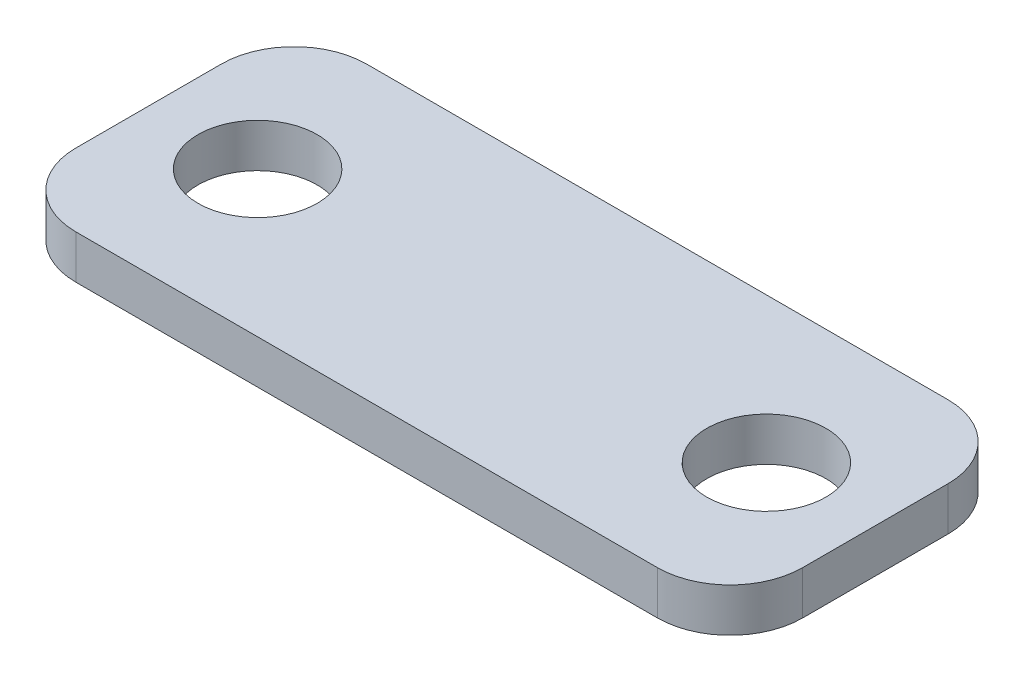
ISO-10303-21;
HEADER;
FILE_DESCRIPTION(('STEP AP214'),'2;1');
FILE_NAME('part.step','',(''),(''),'','','');
FILE_SCHEMA(('AUTOMOTIVE_DESIGN { 1 0 10303 214 1 1 1 1 }'));
ENDSEC;
DATA;
#1=APPLICATION_CONTEXT('core data for automotive mechanical design processes');
#2=APPLICATION_PROTOCOL_DEFINITION('international standard','automotive_design',2000,#1);
#3=PRODUCT_CONTEXT('',#1,'mechanical');
#4=PRODUCT('Part','Part','',(#3));
#5=PRODUCT_RELATED_PRODUCT_CATEGORY('part','',(#4));
#6=PRODUCT_DEFINITION_FORMATION('','',#4);
#7=PRODUCT_DEFINITION_CONTEXT('part definition',#1,'design');
#8=PRODUCT_DEFINITION('design','',#6,#7);
#9=PRODUCT_DEFINITION_SHAPE('','',#8);
#10=(LENGTH_UNIT() NAMED_UNIT(*) SI_UNIT(.MILLI.,.METRE.));
#11=(NAMED_UNIT(*) PLANE_ANGLE_UNIT() SI_UNIT($,.RADIAN.));
#12=(NAMED_UNIT(*) SI_UNIT($,.STERADIAN.) SOLID_ANGLE_UNIT());
#13=UNCERTAINTY_MEASURE_WITH_UNIT(LENGTH_MEASURE(1.E-05),#10,'distance_accuracy_value','');
#14=(GEOMETRIC_REPRESENTATION_CONTEXT(3) GLOBAL_UNCERTAINTY_ASSIGNED_CONTEXT((#13)) GLOBAL_UNIT_ASSIGNED_CONTEXT((#10,
#11,#12)) REPRESENTATION_CONTEXT('',''));
#15=CARTESIAN_POINT('',(0.,0.,0.));
#16=DIRECTION('',(0.,0.,1.));
#17=DIRECTION('',(1.,0.,0.));
#18=AXIS2_PLACEMENT_3D('',#15,#16,#17);
#19=CARTESIAN_POINT('',(25.,3.,10.));
#20=DIRECTION('',(-1.,0.,0.));
#21=DIRECTION('',(0.,0.,1.));
#22=AXIS2_PLACEMENT_3D('',#19,#20,#21);
#23=PLANE('',#22);
#24=DIRECTION('',(0.,0.,-1.));
#25=VECTOR('',#24,1.);
#26=CARTESIAN_POINT('',(25.,0.,10.));
#27=LINE('',#26,#25);
#28=CARTESIAN_POINT('',(25.,0.,5.));
#29=VERTEX_POINT('',#28);
#30=CARTESIAN_POINT('',(25.,0.,-5.));
#31=VERTEX_POINT('',#30);
#32=EDGE_CURVE('E127',#29,#31,#27,.T.);
#33=ORIENTED_EDGE('',*,*,#32,.T.);
#34=DIRECTION('',(0.,-1.,0.));
#35=VECTOR('',#34,1.);
#36=CARTESIAN_POINT('',(25.,3.,-5.));
#37=LINE('',#36,#35);
#38=CARTESIAN_POINT('',(25.,3.,-5.));
#39=VERTEX_POINT('',#38);
#40=EDGE_CURVE('E105',#31,#39,#37,.F.);
#41=ORIENTED_EDGE('',*,*,#40,.T.);
#42=DIRECTION('',(0.,0.,-1.));
#43=VECTOR('',#42,1.);
#44=CARTESIAN_POINT('',(25.,3.,10.));
#45=LINE('',#44,#43);
#46=CARTESIAN_POINT('',(25.,3.,5.));
#47=VERTEX_POINT('',#46);
#48=EDGE_CURVE('E137',#47,#39,#45,.T.);
#49=ORIENTED_EDGE('',*,*,#48,.F.);
#50=DIRECTION('',(0.,-1.,0.));
#51=VECTOR('',#50,1.);
#52=CARTESIAN_POINT('',(25.,3.,5.));
#53=LINE('',#52,#51);
#54=EDGE_CURVE('E110',#47,#29,#53,.T.);
#55=ORIENTED_EDGE('',*,*,#54,.T.);
#56=EDGE_LOOP('',(#33,#41,#49,#55));
#57=FACE_BOUND('',#56,.T.);
#58=ADVANCED_FACE('F34',(#57),#23,.F.);
#59=CARTESIAN_POINT('',(-25.,3.,-10.));
#60=DIRECTION('',(0.,0.,1.));
#61=DIRECTION('',(1.,0.,0.));
#62=AXIS2_PLACEMENT_3D('',#59,#60,#61);
#63=PLANE('',#62);
#64=DIRECTION('',(-1.,0.,0.));
#65=VECTOR('',#64,1.);
#66=CARTESIAN_POINT('',(-25.,3.,-10.));
#67=LINE('',#66,#65);
#68=CARTESIAN_POINT('',(20.,3.,-10.));
#69=VERTEX_POINT('',#68);
#70=CARTESIAN_POINT('',(-20.,3.,-10.));
#71=VERTEX_POINT('',#70);
#72=EDGE_CURVE('E120',#69,#71,#67,.T.);
#73=ORIENTED_EDGE('',*,*,#72,.F.);
#74=DIRECTION('',(0.,-1.,0.));
#75=VECTOR('',#74,1.);
#76=CARTESIAN_POINT('',(20.,3.,-10.));
#77=LINE('',#76,#75);
#78=CARTESIAN_POINT('',(20.,0.,-10.));
#79=VERTEX_POINT('',#78);
#80=EDGE_CURVE('E104',#69,#79,#77,.T.);
#81=ORIENTED_EDGE('',*,*,#80,.T.);
#82=DIRECTION('',(-1.,0.,0.));
#83=VECTOR('',#82,1.);
#84=CARTESIAN_POINT('',(-25.,0.,-10.));
#85=LINE('',#84,#83);
#86=CARTESIAN_POINT('',(-20.,0.,-10.));
#87=VERTEX_POINT('',#86);
#88=EDGE_CURVE('E117',#79,#87,#85,.T.);
#89=ORIENTED_EDGE('',*,*,#88,.T.);
#90=DIRECTION('',(0.,-1.,0.));
#91=VECTOR('',#90,1.);
#92=CARTESIAN_POINT('',(-20.,3.,-10.));
#93=LINE('',#92,#91);
#94=EDGE_CURVE('E122',#87,#71,#93,.F.);
#95=ORIENTED_EDGE('',*,*,#94,.T.);
#96=EDGE_LOOP('',(#73,#81,#89,#95));
#97=FACE_BOUND('',#96,.T.);
#98=ADVANCED_FACE('F116',(#97),#63,.F.);
#99=CARTESIAN_POINT('',(-25.,3.,10.));
#100=DIRECTION('',(1.,0.,0.));
#101=DIRECTION('',(0.,0.,-1.));
#102=AXIS2_PLACEMENT_3D('',#99,#100,#101);
#103=PLANE('',#102);
#104=DIRECTION('',(0.,0.,1.));
#105=VECTOR('',#104,1.);
#106=CARTESIAN_POINT('',(-25.,0.,10.));
#107=LINE('',#106,#105);
#108=CARTESIAN_POINT('',(-25.,0.,-5.));
#109=VERTEX_POINT('',#108);
#110=CARTESIAN_POINT('',(-25.,0.,5.));
#111=VERTEX_POINT('',#110);
#112=EDGE_CURVE('E126',#109,#111,#107,.T.);
#113=ORIENTED_EDGE('',*,*,#112,.T.);
#114=DIRECTION('',(0.,-1.,0.));
#115=VECTOR('',#114,1.);
#116=CARTESIAN_POINT('',(-25.,3.,5.));
#117=LINE('',#116,#115);
#118=CARTESIAN_POINT('',(-25.,3.,5.));
#119=VERTEX_POINT('',#118);
#120=EDGE_CURVE('E11',#111,#119,#117,.F.);
#121=ORIENTED_EDGE('',*,*,#120,.T.);
#122=DIRECTION('',(0.,0.,1.));
#123=VECTOR('',#122,1.);
#124=CARTESIAN_POINT('',(-25.,3.,10.));
#125=LINE('',#124,#123);
#126=CARTESIAN_POINT('',(-25.,3.,-5.));
#127=VERTEX_POINT('',#126);
#128=EDGE_CURVE('E163',#127,#119,#125,.T.);
#129=ORIENTED_EDGE('',*,*,#128,.F.);
#130=DIRECTION('',(0.,-1.,0.));
#131=VECTOR('',#130,1.);
#132=CARTESIAN_POINT('',(-25.,3.,-5.));
#133=LINE('',#132,#131);
#134=EDGE_CURVE('E42',#127,#109,#133,.T.);
#135=ORIENTED_EDGE('',*,*,#134,.T.);
#136=EDGE_LOOP('',(#113,#121,#129,#135));
#137=FACE_BOUND('',#136,.T.);
#138=ADVANCED_FACE('F161',(#137),#103,.F.);
#139=CARTESIAN_POINT('',(-25.,3.,10.));
#140=DIRECTION('',(0.,0.,-1.));
#141=DIRECTION('',(-1.,0.,0.));
#142=AXIS2_PLACEMENT_3D('',#139,#140,#141);
#143=PLANE('',#142);
#144=DIRECTION('',(1.,0.,0.));
#145=VECTOR('',#144,1.);
#146=CARTESIAN_POINT('',(-25.,0.,10.));
#147=LINE('',#146,#145);
#148=CARTESIAN_POINT('',(-20.,0.,10.));
#149=VERTEX_POINT('',#148);
#150=CARTESIAN_POINT('',(20.,0.,10.));
#151=VERTEX_POINT('',#150);
#152=EDGE_CURVE('E130',#149,#151,#147,.T.);
#153=ORIENTED_EDGE('',*,*,#152,.T.);
#154=DIRECTION('',(0.,-1.,0.));
#155=VECTOR('',#154,1.);
#156=CARTESIAN_POINT('',(20.,3.,10.));
#157=LINE('',#156,#155);
#158=CARTESIAN_POINT('',(20.,3.,10.));
#159=VERTEX_POINT('',#158);
#160=EDGE_CURVE('E49',#151,#159,#157,.F.);
#161=ORIENTED_EDGE('',*,*,#160,.T.);
#162=DIRECTION('',(1.,0.,0.));
#163=VECTOR('',#162,1.);
#164=CARTESIAN_POINT('',(-25.,3.,10.));
#165=LINE('',#164,#163);
#166=CARTESIAN_POINT('',(-20.,3.,10.));
#167=VERTEX_POINT('',#166);
#168=EDGE_CURVE('E138',#167,#159,#165,.T.);
#169=ORIENTED_EDGE('',*,*,#168,.F.);
#170=DIRECTION('',(0.,-1.,0.));
#171=VECTOR('',#170,1.);
#172=CARTESIAN_POINT('',(-20.,3.,10.));
#173=LINE('',#172,#171);
#174=EDGE_CURVE('E154',#167,#149,#173,.T.);
#175=ORIENTED_EDGE('',*,*,#174,.T.);
#176=EDGE_LOOP('',(#153,#161,#169,#175));
#177=FACE_BOUND('',#176,.T.);
#178=ADVANCED_FACE('F170',(#177),#143,.F.);
#179=CARTESIAN_POINT('',(0.,3.,0.));
#180=DIRECTION('',(0.,-1.,0.));
#181=DIRECTION('',(0.,0.,-1.));
#182=AXIS2_PLACEMENT_3D('',#179,#180,#181);
#183=PLANE('',#182);
#184=CARTESIAN_POINT('',(-17.5,3.,0.));
#185=DIRECTION('',(0.,1.,0.));
#186=DIRECTION('',(0.,0.,1.));
#187=AXIS2_PLACEMENT_3D('',#184,#185,#186);
#188=CIRCLE('',#187,4.1);
#189=CARTESIAN_POINT('',(-17.5,3.,4.1));
#190=VERTEX_POINT('',#189);
#191=EDGE_CURVE('E183',#190,#190,#188,.T.);
#192=ORIENTED_EDGE('',*,*,#191,.F.);
#193=EDGE_LOOP('',(#192));
#194=FACE_BOUND('',#193,.T.);
#195=CARTESIAN_POINT('',(17.5,3.,0.));
#196=DIRECTION('',(0.,1.,0.));
#197=DIRECTION('',(0.,0.,1.));
#198=AXIS2_PLACEMENT_3D('',#195,#196,#197);
#199=CIRCLE('',#198,4.1);
#200=CARTESIAN_POINT('',(17.5,3.,4.1));
#201=VERTEX_POINT('',#200);
#202=EDGE_CURVE('E177',#201,#201,#199,.T.);
#203=ORIENTED_EDGE('',*,*,#202,.F.);
#204=EDGE_LOOP('',(#203));
#205=FACE_BOUND('',#204,.T.);
#206=ORIENTED_EDGE('',*,*,#48,.T.);
#207=CARTESIAN_POINT('',(20.,3.,-5.));
#208=DIRECTION('',(0.,-1.,0.));
#209=DIRECTION('',(0.,0.,-1.));
#210=AXIS2_PLACEMENT_3D('',#207,#208,#209);
#211=CIRCLE('',#210,5.);
#212=EDGE_CURVE('E152',#39,#69,#211,.F.);
#213=ORIENTED_EDGE('',*,*,#212,.T.);
#214=ORIENTED_EDGE('',*,*,#72,.T.);
#215=CARTESIAN_POINT('',(-20.,3.,-5.));
#216=DIRECTION('',(0.,-1.,0.));
#217=DIRECTION('',(0.,0.,-1.));
#218=AXIS2_PLACEMENT_3D('',#215,#216,#217);
#219=CIRCLE('',#218,5.);
#220=EDGE_CURVE('E147',#71,#127,#219,.F.);
#221=ORIENTED_EDGE('',*,*,#220,.T.);
#222=ORIENTED_EDGE('',*,*,#128,.T.);
#223=CARTESIAN_POINT('',(-20.,3.,5.));
#224=DIRECTION('',(0.,-1.,0.));
#225=DIRECTION('',(0.,0.,-1.));
#226=AXIS2_PLACEMENT_3D('',#223,#224,#225);
#227=CIRCLE('',#226,5.);
#228=EDGE_CURVE('E56',#119,#167,#227,.F.);
#229=ORIENTED_EDGE('',*,*,#228,.T.);
#230=ORIENTED_EDGE('',*,*,#168,.T.);
#231=CARTESIAN_POINT('',(20.,3.,5.));
#232=DIRECTION('',(0.,-1.,0.));
#233=DIRECTION('',(0.,0.,-1.));
#234=AXIS2_PLACEMENT_3D('',#231,#232,#233);
#235=CIRCLE('',#234,5.);
#236=EDGE_CURVE('E150',#159,#47,#235,.F.);
#237=ORIENTED_EDGE('',*,*,#236,.T.);
#238=EDGE_LOOP('',(#206,#213,#214,#221,#222,#229,#230,#237));
#239=FACE_BOUND('',#238,.T.);
#240=ADVANCED_FACE('F198',(#194,#205,#239),#183,.F.);
#241=CARTESIAN_POINT('',(0.,0.,0.));
#242=DIRECTION('',(0.,-1.,0.));
#243=DIRECTION('',(0.,0.,-1.));
#244=AXIS2_PLACEMENT_3D('',#241,#242,#243);
#245=PLANE('',#244);
#246=CARTESIAN_POINT('',(-17.5,0.,0.));
#247=DIRECTION('',(0.,1.,0.));
#248=DIRECTION('',(0.,0.,1.));
#249=AXIS2_PLACEMENT_3D('',#246,#247,#248);
#250=CIRCLE('',#249,4.1);
#251=CARTESIAN_POINT('',(-17.5,0.,4.1));
#252=VERTEX_POINT('',#251);
#253=EDGE_CURVE('E132',#252,#252,#250,.T.);
#254=ORIENTED_EDGE('',*,*,#253,.T.);
#255=EDGE_LOOP('',(#254));
#256=FACE_BOUND('',#255,.T.);
#257=CARTESIAN_POINT('',(17.5,0.,0.));
#258=DIRECTION('',(0.,1.,0.));
#259=DIRECTION('',(0.,0.,1.));
#260=AXIS2_PLACEMENT_3D('',#257,#258,#259);
#261=CIRCLE('',#260,4.1);
#262=CARTESIAN_POINT('',(17.5,0.,4.1));
#263=VERTEX_POINT('',#262);
#264=EDGE_CURVE('E180',#263,#263,#261,.T.);
#265=ORIENTED_EDGE('',*,*,#264,.T.);
#266=EDGE_LOOP('',(#265));
#267=FACE_BOUND('',#266,.T.);
#268=ORIENTED_EDGE('',*,*,#88,.F.);
#269=CARTESIAN_POINT('',(20.,0.,-5.));
#270=DIRECTION('',(0.,-1.,0.));
#271=DIRECTION('',(0.,0.,-1.));
#272=AXIS2_PLACEMENT_3D('',#269,#270,#271);
#273=CIRCLE('',#272,5.);
#274=EDGE_CURVE('E100',#79,#31,#273,.T.);
#275=ORIENTED_EDGE('',*,*,#274,.T.);
#276=ORIENTED_EDGE('',*,*,#32,.F.);
#277=CARTESIAN_POINT('',(20.,0.,5.));
#278=DIRECTION('',(0.,-1.,0.));
#279=DIRECTION('',(0.,0.,-1.));
#280=AXIS2_PLACEMENT_3D('',#277,#278,#279);
#281=CIRCLE('',#280,5.);
#282=EDGE_CURVE('E111',#29,#151,#281,.T.);
#283=ORIENTED_EDGE('',*,*,#282,.T.);
#284=ORIENTED_EDGE('',*,*,#152,.F.);
#285=CARTESIAN_POINT('',(-20.,0.,5.));
#286=DIRECTION('',(0.,-1.,0.));
#287=DIRECTION('',(0.,0.,-1.));
#288=AXIS2_PLACEMENT_3D('',#285,#286,#287);
#289=CIRCLE('',#288,5.);
#290=EDGE_CURVE('E141',#149,#111,#289,.T.);
#291=ORIENTED_EDGE('',*,*,#290,.T.);
#292=ORIENTED_EDGE('',*,*,#112,.F.);
#293=CARTESIAN_POINT('',(-20.,0.,-5.));
#294=DIRECTION('',(0.,-1.,0.));
#295=DIRECTION('',(0.,0.,-1.));
#296=AXIS2_PLACEMENT_3D('',#293,#294,#295);
#297=CIRCLE('',#296,5.);
#298=EDGE_CURVE('E121',#109,#87,#297,.T.);
#299=ORIENTED_EDGE('',*,*,#298,.T.);
#300=EDGE_LOOP('',(#268,#275,#276,#283,#284,#291,#292,#299));
#301=FACE_BOUND('',#300,.T.);
#302=ADVANCED_FACE('F124',(#256,#267,#301),#245,.T.);
#303=CARTESIAN_POINT('',(17.5,0.,0.));
#304=DIRECTION('',(0.,1.,0.));
#305=DIRECTION('',(0.,0.,1.));
#306=AXIS2_PLACEMENT_3D('',#303,#304,#305);
#307=CYLINDRICAL_SURFACE('',#306,4.1);
#308=ORIENTED_EDGE('',*,*,#264,.F.);
#309=EDGE_LOOP('',(#308));
#310=FACE_BOUND('',#309,.T.);
#311=ORIENTED_EDGE('',*,*,#202,.T.);
#312=EDGE_LOOP('',(#311));
#313=FACE_BOUND('',#312,.T.);
#314=ADVANCED_FACE('F194',(#310,#313),#307,.F.);
#315=CARTESIAN_POINT('',(-17.5,0.,0.));
#316=DIRECTION('',(0.,1.,0.));
#317=DIRECTION('',(0.,0.,1.));
#318=AXIS2_PLACEMENT_3D('',#315,#316,#317);
#319=CYLINDRICAL_SURFACE('',#318,4.1);
#320=ORIENTED_EDGE('',*,*,#253,.F.);
#321=EDGE_LOOP('',(#320));
#322=FACE_BOUND('',#321,.T.);
#323=ORIENTED_EDGE('',*,*,#191,.T.);
#324=EDGE_LOOP('',(#323));
#325=FACE_BOUND('',#324,.T.);
#326=ADVANCED_FACE('F191',(#322,#325),#319,.F.);
#327=CARTESIAN_POINT('',(20.,3.,-5.));
#328=DIRECTION('',(0.,-1.,0.));
#329=DIRECTION('',(0.,0.,-1.));
#330=AXIS2_PLACEMENT_3D('',#327,#328,#329);
#331=CYLINDRICAL_SURFACE('',#330,5.);
#332=ORIENTED_EDGE('',*,*,#212,.F.);
#333=ORIENTED_EDGE('',*,*,#40,.F.);
#334=ORIENTED_EDGE('',*,*,#274,.F.);
#335=ORIENTED_EDGE('',*,*,#80,.F.);
#336=EDGE_LOOP('',(#332,#333,#334,#335));
#337=FACE_BOUND('',#336,.T.);
#338=ADVANCED_FACE('F103',(#337),#331,.T.);
#339=CARTESIAN_POINT('',(20.,3.,5.));
#340=DIRECTION('',(0.,-1.,0.));
#341=DIRECTION('',(0.,0.,-1.));
#342=AXIS2_PLACEMENT_3D('',#339,#340,#341);
#343=CYLINDRICAL_SURFACE('',#342,5.);
#344=ORIENTED_EDGE('',*,*,#236,.F.);
#345=ORIENTED_EDGE('',*,*,#160,.F.);
#346=ORIENTED_EDGE('',*,*,#282,.F.);
#347=ORIENTED_EDGE('',*,*,#54,.F.);
#348=EDGE_LOOP('',(#344,#345,#346,#347));
#349=FACE_BOUND('',#348,.T.);
#350=ADVANCED_FACE('F207',(#349),#343,.T.);
#351=CARTESIAN_POINT('',(-20.,3.,5.));
#352=DIRECTION('',(0.,-1.,0.));
#353=DIRECTION('',(0.,0.,-1.));
#354=AXIS2_PLACEMENT_3D('',#351,#352,#353);
#355=CYLINDRICAL_SURFACE('',#354,5.);
#356=ORIENTED_EDGE('',*,*,#228,.F.);
#357=ORIENTED_EDGE('',*,*,#120,.F.);
#358=ORIENTED_EDGE('',*,*,#290,.F.);
#359=ORIENTED_EDGE('',*,*,#174,.F.);
#360=EDGE_LOOP('',(#356,#357,#358,#359));
#361=FACE_BOUND('',#360,.T.);
#362=ADVANCED_FACE('F169',(#361),#355,.T.);
#363=CARTESIAN_POINT('',(-20.,3.,-5.));
#364=DIRECTION('',(0.,-1.,0.));
#365=DIRECTION('',(0.,0.,-1.));
#366=AXIS2_PLACEMENT_3D('',#363,#364,#365);
#367=CYLINDRICAL_SURFACE('',#366,5.);
#368=ORIENTED_EDGE('',*,*,#220,.F.);
#369=ORIENTED_EDGE('',*,*,#94,.F.);
#370=ORIENTED_EDGE('',*,*,#298,.F.);
#371=ORIENTED_EDGE('',*,*,#134,.F.);
#372=EDGE_LOOP('',(#368,#369,#370,#371));
#373=FACE_BOUND('',#372,.T.);
#374=ADVANCED_FACE('F36',(#373),#367,.T.);
#375=CLOSED_SHELL('',(#58,#98,#138,#178,#240,#302,#314,#326,#338,#350,#362,#374));
#376=MANIFOLD_SOLID_BREP('B2',#375);
#377=ADVANCED_BREP_SHAPE_REPRESENTATION('',(#18,#376),#14);
#378=SHAPE_DEFINITION_REPRESENTATION(#9,#377);
ENDSEC;
END-ISO-10303-21;
